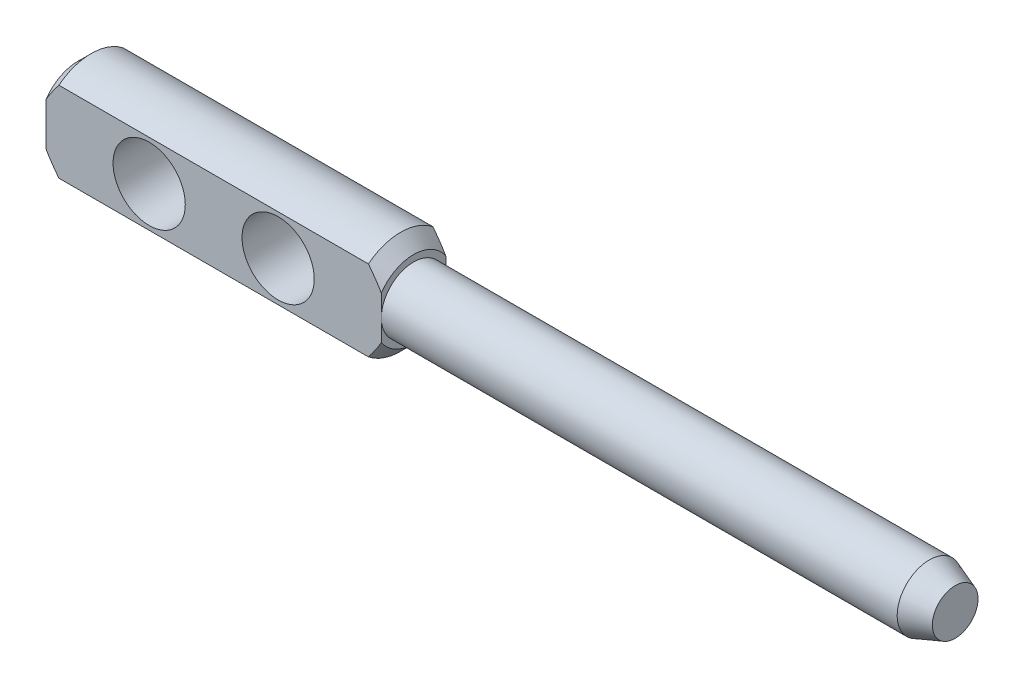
from build123d import *

# Parameters (mm, degrees)
SKETCH2_OUTSIDE_W   = 12.894
SKETCH2_OUTSIDE_H   = 12.894
SKETCH2_OUTSIDE_W_2 = 2.5
SKETCH2_OUTSIDE_H_2 = 4
CUT_EXTRUDE1_DEPTH  = 19
SKETCH4_R           = 1.4
CUT_EXTRUDE2_DEPTH  = 35.150402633


with BuildPart() as part:
    # Sketch1 → Revolve1 (revolve)
    with BuildSketch(Plane.XY, mode=Mode.PRIVATE) as revolve1_sk:
        Polygon((0, 0), (0, 1.5), (0.5, 2), (12.5, 2), (13, 1.5), (13, 1.25), (33, 1.25), (34, 0.886029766), (34, 0), align=None)
    revolve(revolve1_sk.sketch.rotate(Axis((0, 0, 0), (1, 0, 0)), 90), axis=Axis((0, 0, 0), (1, 0, 0)))

    # Sketch2 outside → Cut-Extrude1 (cut)
    with BuildSketch(Plane.ZY):
        Rectangle(SKETCH2_OUTSIDE_W, SKETCH2_OUTSIDE_H)
        Rectangle(SKETCH2_OUTSIDE_W_2, SKETCH2_OUTSIDE_H_2, mode=Mode.SUBTRACT)
    extrude(amount=-CUT_EXTRUDE1_DEPTH, mode=Mode.SUBTRACT)

    # Sketch4 → Cut-Extrude2 (cut, through all)
    with BuildSketch(Plane.XY.offset(1.25)):
        with Locations((4, 0)):
            Circle(SKETCH4_R)
        with Locations((9, 0)):
            Circle(SKETCH4_R)
    extrude(amount=-CUT_EXTRUDE2_DEPTH, mode=Mode.SUBTRACT)


solid = part.part
